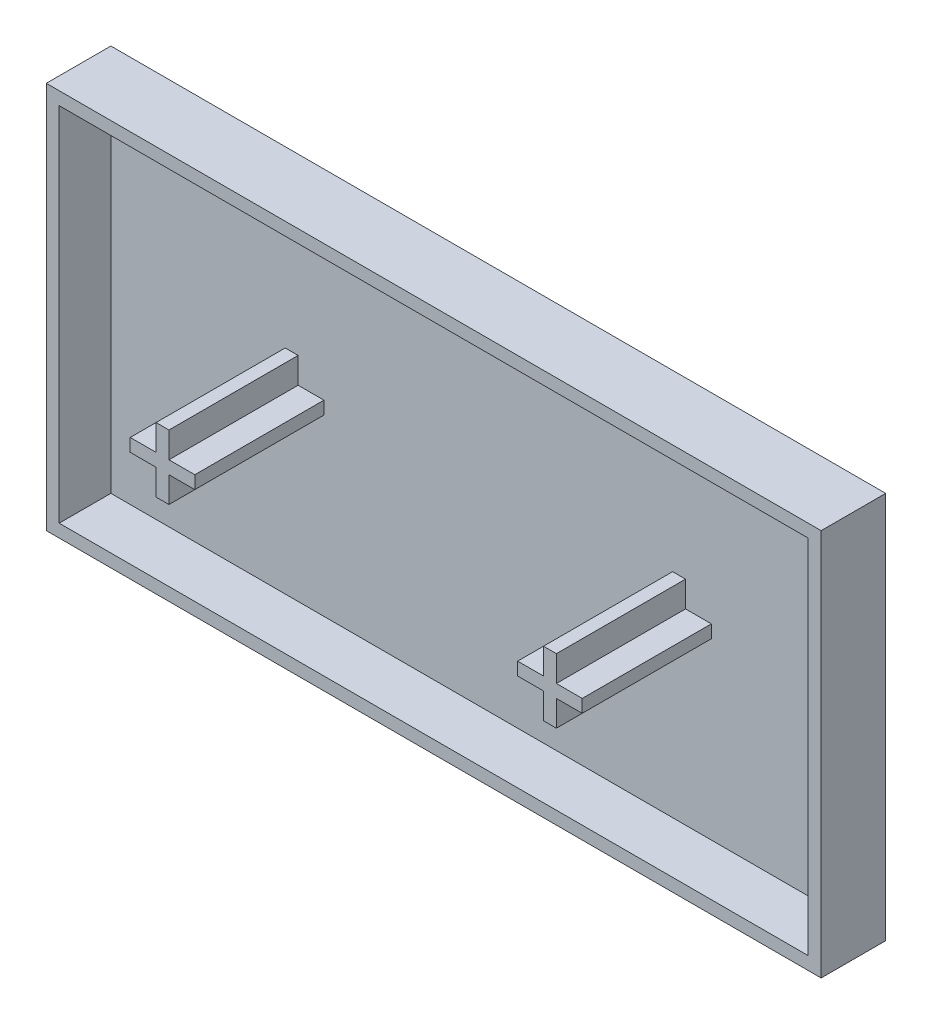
from build123d import *

# Parameters (mm, degrees)
SKETCH_1_W      = 60
SKETCH_1_H      = 30
EXTRUDE_1_DEPTH = 2.5
SHELL_1_T       = -1
EXTRUDE_2_DEPTH = 10


with BuildPart() as part:
    # Sketch 1 → Extrude 1 (new, symmetric)
    with BuildSketch(Plane.XY):
        Rectangle(SKETCH_1_W, SKETCH_1_H)
    extrude(amount=EXTRUDE_1_DEPTH, both=True)

    # Shell 1
    shell_1_openings = [part.faces().sort_by_distance(p)[0] for p in [
        (0, 0, 2.5),
    ]]
    offset(amount=SHELL_1_T, openings=shell_1_openings, kind=Kind.INTERSECTION)

    # Sketch 2 → Extrude 2 (add)
    with BuildSketch(Plane.XY.offset(-1.5)):
        Polygon((-14.5, 0.5), (-12.5, 0.5), (-12.5, -0.5), (-14.5, -0.5), (-14.5, -2.5), (-15.5, -2.5), (-15.5, -0.5), (-17.5, -0.5), (-17.5, 0.5), (-15.5, 0.5), (-15.5, 2.5), (-14.5, 2.5), align=None)
        Polygon((14.5, -0.5), (14.5, -2.5), (15.5, -2.5), (15.5, -0.5), (17.5, -0.5), (17.5, 0.5), (15.5, 0.5), (15.5, 2.5), (14.5, 2.5), (14.5, 0.5), (12.5, 0.5), (12.5, -0.5), align=None)
    extrude(amount=EXTRUDE_2_DEPTH)


solid = part.part
